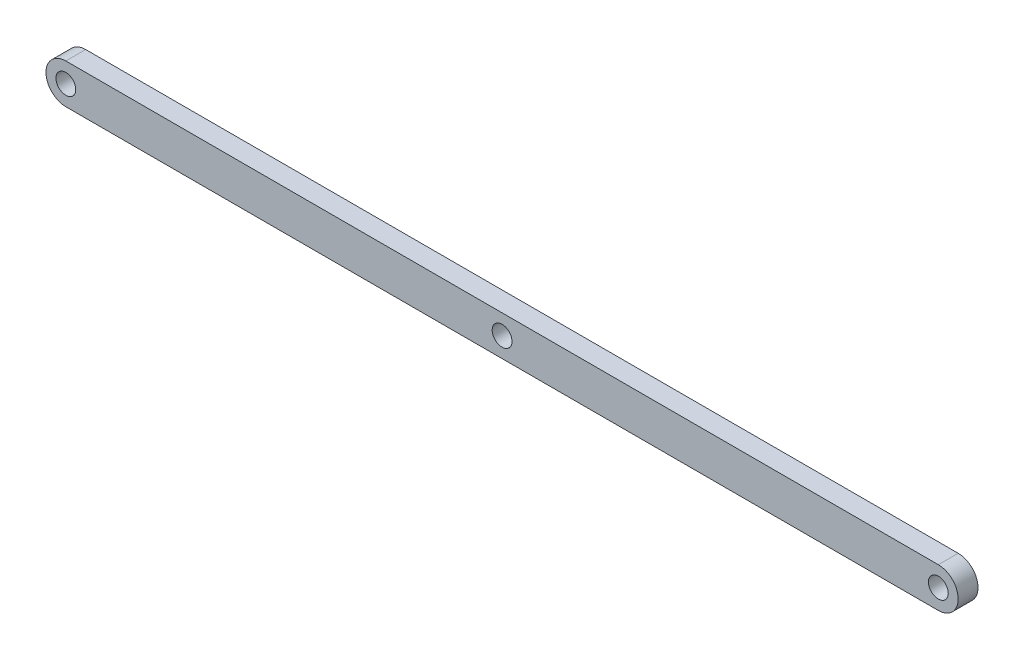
from build123d import *

# Parameters (mm, degrees)
SKETCH1_R           = 1.5875
BOSS_EXTRUDE1_DEPTH = 3.175


with BuildPart() as part:
    # Sketch1 → Boss-Extrude1 (new body)
    with BuildSketch(Plane.XY):
        with BuildLine():
            Line((0, 3.175), (139.7, 3.175))
            ThreePointArc((139.7, 3.175), (142.875, 0), (139.7, -3.175))
            Line((139.7, -3.175), (0, -3.175))
            ThreePointArc((0, -3.175), (-3.175, 0), (0, 3.175))
        make_face()
        Circle(SKETCH1_R, mode=Mode.SUBTRACT)
        with Locations((139.7, 0)):
            Circle(SKETCH1_R, mode=Mode.SUBTRACT)
        with Locations((69.85, 0)):
            Circle(SKETCH1_R, mode=Mode.SUBTRACT)
    extrude(amount=BOSS_EXTRUDE1_DEPTH)


solid = part.part
